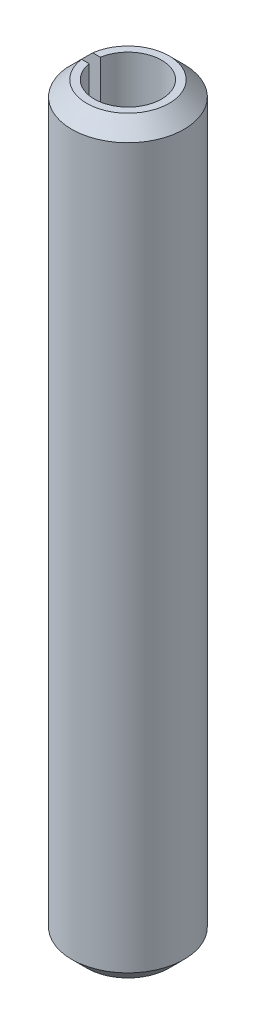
ISO-10303-21;
HEADER;
FILE_DESCRIPTION(('STEP AP214'),'2;1');
FILE_NAME('part.step','',(''),(''),'','','');
FILE_SCHEMA(('AUTOMOTIVE_DESIGN { 1 0 10303 214 1 1 1 1 }'));
ENDSEC;
DATA;
#1=APPLICATION_CONTEXT('core data for automotive mechanical design processes');
#2=APPLICATION_PROTOCOL_DEFINITION('international standard','automotive_design',2000,#1);
#3=PRODUCT_CONTEXT('',#1,'mechanical');
#4=PRODUCT('Part','Part','',(#3));
#5=PRODUCT_RELATED_PRODUCT_CATEGORY('part','',(#4));
#6=PRODUCT_DEFINITION_FORMATION('','',#4);
#7=PRODUCT_DEFINITION_CONTEXT('part definition',#1,'design');
#8=PRODUCT_DEFINITION('design','',#6,#7);
#9=PRODUCT_DEFINITION_SHAPE('','',#8);
#10=(LENGTH_UNIT() NAMED_UNIT(*) SI_UNIT(.MILLI.,.METRE.));
#11=(NAMED_UNIT(*) PLANE_ANGLE_UNIT() SI_UNIT($,.RADIAN.));
#12=(NAMED_UNIT(*) SI_UNIT($,.STERADIAN.) SOLID_ANGLE_UNIT());
#13=UNCERTAINTY_MEASURE_WITH_UNIT(LENGTH_MEASURE(1.E-05),#10,'distance_accuracy_value','');
#14=(GEOMETRIC_REPRESENTATION_CONTEXT(3) GLOBAL_UNCERTAINTY_ASSIGNED_CONTEXT((#13)) GLOBAL_UNIT_ASSIGNED_CONTEXT((#10,
#11,#12)) REPRESENTATION_CONTEXT('',''));
#15=CARTESIAN_POINT('',(0.,0.,0.));
#16=DIRECTION('',(0.,0.,1.));
#17=DIRECTION('',(1.,0.,0.));
#18=AXIS2_PLACEMENT_3D('',#15,#16,#17);
#19=CARTESIAN_POINT('',(1.8,20.,0.));
#20=DIRECTION('',(0.,-1.,0.));
#21=DIRECTION('',(0.,0.,-1.));
#22=AXIS2_PLACEMENT_3D('',#19,#20,#21);
#23=PLANE('',#22);
#24=CARTESIAN_POINT('',(0.,20.,0.));
#25=DIRECTION('',(0.,-1.,0.));
#26=DIRECTION('',(0.,0.,-1.));
#27=AXIS2_PLACEMENT_3D('',#24,#25,#26);
#28=CIRCLE('',#27,2.2);
#29=CARTESIAN_POINT('',(-2.17944947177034,20.,0.3));
#30=VERTEX_POINT('',#29);
#31=CARTESIAN_POINT('',(-2.17944947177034,20.,-0.3));
#32=VERTEX_POINT('',#31);
#33=EDGE_CURVE('E112',#30,#32,#28,.F.);
#34=ORIENTED_EDGE('',*,*,#33,.T.);
#35=DIRECTION('',(-1.,0.,0.));
#36=VECTOR('',#35,1.);
#37=CARTESIAN_POINT('',(0.,20.,-0.3));
#38=LINE('',#37,#36);
#39=CARTESIAN_POINT('',(-1.77482393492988,20.,-0.3));
#40=VERTEX_POINT('',#39);
#41=EDGE_CURVE('E162',#40,#32,#38,.T.);
#42=ORIENTED_EDGE('',*,*,#41,.F.);
#43=CARTESIAN_POINT('',(0.,20.,0.));
#44=DIRECTION('',(0.,1.,0.));
#45=DIRECTION('',(0.,0.,1.));
#46=AXIS2_PLACEMENT_3D('',#43,#44,#45);
#47=CIRCLE('',#46,1.8);
#48=CARTESIAN_POINT('',(-1.77482393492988,20.,0.3));
#49=VERTEX_POINT('',#48);
#50=EDGE_CURVE('E108',#49,#40,#47,.T.);
#51=ORIENTED_EDGE('',*,*,#50,.F.);
#52=DIRECTION('',(1.,0.,0.));
#53=VECTOR('',#52,1.);
#54=CARTESIAN_POINT('',(0.,20.,0.3));
#55=LINE('',#54,#53);
#56=EDGE_CURVE('E99',#30,#49,#55,.T.);
#57=ORIENTED_EDGE('',*,*,#56,.F.);
#58=EDGE_LOOP('',(#34,#42,#51,#57));
#59=FACE_BOUND('',#58,.T.);
#60=ADVANCED_FACE('F35',(#59),#23,.F.);
#61=CARTESIAN_POINT('',(0.,20.,0.));
#62=DIRECTION('',(0.,1.,0.));
#63=DIRECTION('',(0.,0.,1.));
#64=AXIS2_PLACEMENT_3D('',#61,#62,#63);
#65=CYLINDRICAL_SURFACE('',#64,3.);
#66=CARTESIAN_POINT('',(0.,-19.2,0.));
#67=DIRECTION('',(0.,1.,0.));
#68=DIRECTION('',(0.,0.,1.));
#69=AXIS2_PLACEMENT_3D('',#66,#67,#68);
#70=CIRCLE('',#69,3.);
#71=CARTESIAN_POINT('',(-2.98496231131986,-19.2,0.3));
#72=VERTEX_POINT('',#71);
#73=CARTESIAN_POINT('',(-2.98496231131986,-19.2,-0.3));
#74=VERTEX_POINT('',#73);
#75=EDGE_CURVE('E115',#72,#74,#70,.T.);
#76=ORIENTED_EDGE('',*,*,#75,.T.);
#77=DIRECTION('',(0.,1.,0.));
#78=VECTOR('',#77,1.);
#79=CARTESIAN_POINT('',(-2.98496231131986,20.,-0.3));
#80=LINE('',#79,#78);
#81=CARTESIAN_POINT('',(-2.98496231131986,19.2,-0.3));
#82=VERTEX_POINT('',#81);
#83=EDGE_CURVE('E54',#74,#82,#80,.T.);
#84=ORIENTED_EDGE('',*,*,#83,.T.);
#85=CARTESIAN_POINT('',(0.,19.2,0.));
#86=DIRECTION('',(0.,-1.,0.));
#87=DIRECTION('',(0.,0.,-1.));
#88=AXIS2_PLACEMENT_3D('',#85,#86,#87);
#89=CIRCLE('',#88,3.);
#90=CARTESIAN_POINT('',(-2.98496231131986,19.2,0.3));
#91=VERTEX_POINT('',#90);
#92=EDGE_CURVE('E121',#82,#91,#89,.T.);
#93=ORIENTED_EDGE('',*,*,#92,.T.);
#94=DIRECTION('',(0.,1.,0.));
#95=VECTOR('',#94,1.);
#96=CARTESIAN_POINT('',(-2.98496231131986,20.,0.3));
#97=LINE('',#96,#95);
#98=EDGE_CURVE('E143',#91,#72,#97,.F.);
#99=ORIENTED_EDGE('',*,*,#98,.T.);
#100=EDGE_LOOP('',(#76,#84,#93,#99));
#101=FACE_BOUND('',#100,.T.);
#102=ADVANCED_FACE('F168',(#101),#65,.T.);
#103=CARTESIAN_POINT('',(3.,-20.,0.));
#104=DIRECTION('',(0.,1.,0.));
#105=DIRECTION('',(0.,0.,1.));
#106=AXIS2_PLACEMENT_3D('',#103,#104,#105);
#107=PLANE('',#106);
#108=CARTESIAN_POINT('',(0.,-20.,0.));
#109=DIRECTION('',(0.,1.,0.));
#110=DIRECTION('',(0.,0.,1.));
#111=AXIS2_PLACEMENT_3D('',#108,#109,#110);
#112=CIRCLE('',#111,1.8);
#113=CARTESIAN_POINT('',(-1.77482393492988,-20.,0.3));
#114=VERTEX_POINT('',#113);
#115=CARTESIAN_POINT('',(-1.77482393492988,-20.,-0.3));
#116=VERTEX_POINT('',#115);
#117=EDGE_CURVE('E106',#114,#116,#112,.T.);
#118=ORIENTED_EDGE('',*,*,#117,.T.);
#119=DIRECTION('',(-1.,0.,0.));
#120=VECTOR('',#119,1.);
#121=CARTESIAN_POINT('',(0.,-20.,-0.3));
#122=LINE('',#121,#120);
#123=CARTESIAN_POINT('',(-2.17944947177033,-20.,-0.3));
#124=VERTEX_POINT('',#123);
#125=EDGE_CURVE('E90',#116,#124,#122,.T.);
#126=ORIENTED_EDGE('',*,*,#125,.T.);
#127=CARTESIAN_POINT('',(0.,-20.,0.));
#128=DIRECTION('',(0.,1.,0.));
#129=DIRECTION('',(0.,0.,1.));
#130=AXIS2_PLACEMENT_3D('',#127,#128,#129);
#131=CIRCLE('',#130,2.2);
#132=CARTESIAN_POINT('',(-2.17944947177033,-20.,0.3));
#133=VERTEX_POINT('',#132);
#134=EDGE_CURVE('E124',#124,#133,#131,.F.);
#135=ORIENTED_EDGE('',*,*,#134,.T.);
#136=DIRECTION('',(1.,0.,0.));
#137=VECTOR('',#136,1.);
#138=CARTESIAN_POINT('',(0.,-20.,0.3));
#139=LINE('',#138,#137);
#140=EDGE_CURVE('E62',#133,#114,#139,.T.);
#141=ORIENTED_EDGE('',*,*,#140,.T.);
#142=EDGE_LOOP('',(#118,#126,#135,#141));
#143=FACE_BOUND('',#142,.T.);
#144=ADVANCED_FACE('F111',(#143),#107,.F.);
#145=CARTESIAN_POINT('',(0.,20.,0.));
#146=DIRECTION('',(0.,1.,0.));
#147=DIRECTION('',(0.,0.,1.));
#148=AXIS2_PLACEMENT_3D('',#145,#146,#147);
#149=CYLINDRICAL_SURFACE('',#148,1.8);
#150=ORIENTED_EDGE('',*,*,#50,.T.);
#151=DIRECTION('',(0.,1.,0.));
#152=VECTOR('',#151,1.);
#153=CARTESIAN_POINT('',(-1.77482393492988,20.,-0.3));
#154=LINE('',#153,#152);
#155=EDGE_CURVE('E93',#40,#116,#154,.F.);
#156=ORIENTED_EDGE('',*,*,#155,.T.);
#157=ORIENTED_EDGE('',*,*,#117,.F.);
#158=DIRECTION('',(0.,1.,0.));
#159=VECTOR('',#158,1.);
#160=CARTESIAN_POINT('',(-1.77482393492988,20.,0.3));
#161=LINE('',#160,#159);
#162=EDGE_CURVE('E142',#114,#49,#161,.T.);
#163=ORIENTED_EDGE('',*,*,#162,.T.);
#164=EDGE_LOOP('',(#150,#156,#157,#163));
#165=FACE_BOUND('',#164,.T.);
#166=ADVANCED_FACE('F104',(#165),#149,.F.);
#167=CARTESIAN_POINT('',(0.,20.,0.));
#168=DIRECTION('',(0.,-1.,0.));
#169=DIRECTION('',(0.,0.,-1.));
#170=AXIS2_PLACEMENT_3D('',#167,#168,#169);
#171=CONICAL_SURFACE('',#170,2.2,0.785398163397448);
#172=CARTESIAN_POINT('',(-0.390246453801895,21.7077680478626,-0.3));
#173=CARTESIAN_POINT('',(-0.409115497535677,21.6927967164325,-0.3));
#174=CARTESIAN_POINT('',(-0.427797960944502,21.6775950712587,-0.3));
#175=CARTESIAN_POINT('',(-0.464864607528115,21.64683695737,-0.3));
#176=CARTESIAN_POINT('',(-0.483248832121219,21.6312805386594,-0.3));
#177=CARTESIAN_POINT('',(-0.53806098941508,21.5842427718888,-0.3));
#178=CARTESIAN_POINT('',(-0.574162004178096,21.552381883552,-0.3));
#179=CARTESIAN_POINT('',(-0.645813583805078,21.4880812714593,-0.3));
#180=CARTESIAN_POINT('',(-0.681364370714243,21.455641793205,-0.3));
#181=CARTESIAN_POINT('',(-0.752115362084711,21.3903748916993,-0.3));
#182=CARTESIAN_POINT('',(-0.787315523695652,21.3575474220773,-0.3));
#183=CARTESIAN_POINT('',(-0.898120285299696,21.2534620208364,-0.3));
#184=CARTESIAN_POINT('',(-0.973289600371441,21.181741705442,-0.3));
#185=CARTESIAN_POINT('',(-1.1230727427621,21.0377227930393,-0.3));
#186=CARTESIAN_POINT('',(-1.1976865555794,20.9654241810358,-0.3));
#187=CARTESIAN_POINT('',(-1.42105235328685,20.7480416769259,-0.3));
#188=CARTESIAN_POINT('',(-1.56932956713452,20.6024702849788,-0.3));
#189=CARTESIAN_POINT('',(-1.86548490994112,20.3107044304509,-0.3));
#190=CARTESIAN_POINT('',(-2.01336265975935,20.1645095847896,-0.3));
#191=CARTESIAN_POINT('',(-2.30883849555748,19.8718425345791,-0.3));
#192=CARTESIAN_POINT('',(-2.45643658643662,19.7253703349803,-0.3));
#193=CARTESIAN_POINT('',(-2.78560194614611,19.3983663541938,-0.3));
#194=CARTESIAN_POINT('',(-2.96712874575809,19.2177938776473,-0.3));
#195=CARTESIAN_POINT('',(-3.33004708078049,18.8565106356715,-0.3));
#196=CARTESIAN_POINT('',(-3.51143861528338,18.6757998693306,-0.3));
#197=CARTESIAN_POINT('',(-3.87394471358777,18.3144844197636,-0.3));
#198=CARTESIAN_POINT('',(-4.05505936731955,18.1338798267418,-0.3));
#199=CARTESIAN_POINT('',(-4.41722861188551,17.7726130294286,-0.3));
#200=CARTESIAN_POINT('',(-4.59828320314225,17.5919508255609,-0.3));
#201=CARTESIAN_POINT('',(-4.77932144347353,17.4112722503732,-0.3));
#202=B_SPLINE_CURVE_WITH_KNOTS('',3,(#172,#173,#174,#175,#176,#177,#178,#179,#180,#181,#182,
#183,#184,#185,#186,#187,#188,#189,#190,#191,#192,#193,#194,#195,#196,#197,#198,#199,#200,#201),
.UNSPECIFIED.,.F.,.F.,(4,2,2,2,2,2,2,2,2,2,2,2,2,2,4),(0.,0.0722546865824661,0.144499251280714,
0.288935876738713,0.433312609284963,0.577706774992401,0.889384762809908,1.20107085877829,
1.82443944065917,2.44827195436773,3.07209343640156,3.84022460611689,4.60836088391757,
5.37568403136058,6.14300166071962),.UNSPECIFIED.);
#203=EDGE_CURVE('E109',#32,#82,#202,.T.);
#204=ORIENTED_EDGE('',*,*,#203,.F.);
#205=ORIENTED_EDGE('',*,*,#33,.F.);
#206=CARTESIAN_POINT('',(-4.77932144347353,17.4112722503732,0.3));
#207=CARTESIAN_POINT('',(-4.59817671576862,17.5920569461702,0.3));
#208=CARTESIAN_POINT('',(-4.41701572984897,17.7728253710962,0.3));
#209=CARTESIAN_POINT('',(-4.05464012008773,18.134298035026,0.3));
#210=CARTESIAN_POINT('',(-3.87342549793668,18.3150022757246,0.3));
#211=CARTESIAN_POINT('',(-3.51092544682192,18.6763110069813,0.3));
#212=CARTESIAN_POINT('',(-3.32964002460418,18.8569155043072,0.3));
#213=CARTESIAN_POINT('',(-2.96692860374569,19.2179934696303,0.3));
#214=CARTESIAN_POINT('',(-2.78550260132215,19.3984669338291,0.3));
#215=CARTESIAN_POINT('',(-2.5131682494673,19.6690102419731,0.3));
#216=CARTESIAN_POINT('',(-2.42235013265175,19.7591709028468,0.3));
#217=CARTESIAN_POINT('',(-2.24062993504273,19.9394055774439,0.3));
#218=CARTESIAN_POINT('',(-2.14972785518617,20.0294795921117,0.3));
#219=CARTESIAN_POINT('',(-1.96780974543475,20.209496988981,0.3));
#220=CARTESIAN_POINT('',(-1.87679372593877,20.2994403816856,0.3));
#221=CARTESIAN_POINT('',(-1.69457283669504,20.4791428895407,0.3));
#222=CARTESIAN_POINT('',(-1.60336795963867,20.5689019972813,0.3));
#223=CARTESIAN_POINT('',(-1.42063543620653,20.7481454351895,0.3));
#224=CARTESIAN_POINT('',(-1.32910770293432,20.8376296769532,0.3));
#225=CARTESIAN_POINT('',(-1.19142022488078,20.9714365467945,0.3));
#226=CARTESIAN_POINT('',(-1.14546152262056,21.015965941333,0.3));
#227=CARTESIAN_POINT('',(-1.0533510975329,21.1048287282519,0.3));
#228=CARTESIAN_POINT('',(-1.00719936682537,21.1491621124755,0.3));
#229=CARTESIAN_POINT('',(-0.914595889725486,21.2375577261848,0.3));
#230=CARTESIAN_POINT('',(-0.868144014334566,21.2816198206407,0.3));
#231=CARTESIAN_POINT('',(-0.774818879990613,21.3692869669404,0.3));
#232=CARTESIAN_POINT('',(-0.727945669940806,21.4128920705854,0.3));
#233=CARTESIAN_POINT('',(-0.657088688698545,21.4777284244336,0.3));
#234=CARTESIAN_POINT('',(-0.633372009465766,21.4992510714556,0.3));
#235=CARTESIAN_POINT('',(-0.585697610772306,21.5420249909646,0.3));
#236=CARTESIAN_POINT('',(-0.561739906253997,21.5632762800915,0.3));
#237=CARTESIAN_POINT('',(-0.513488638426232,21.6054169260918,0.3));
#238=CARTESIAN_POINT('',(-0.489194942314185,21.6263061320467,0.3));
#239=CARTESIAN_POINT('',(-0.440122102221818,21.6675156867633,0.3));
#240=CARTESIAN_POINT('',(-0.415342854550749,21.6878359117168,0.3));
#241=CARTESIAN_POINT('',(-0.390246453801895,21.7077680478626,0.3));
#242=B_SPLINE_CURVE_WITH_KNOTS('',3,(#206,#207,#208,#209,#210,#211,#212,#213,#214,#215,#216,
#217,#218,#219,#220,#221,#222,#223,#224,#225,#226,#227,#228,#229,#230,#231,#232,#233,#234,#235,
#236,#237,#238,#239,#240,#241),.UNSPECIFIED.,.F.,.F.,(4,2,2,2,2,2,2,2,2,2,2,2,2,2,2,2,2,4),(0.,
0.767768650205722,1.53551524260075,2.30320101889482,3.07090822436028,3.45482467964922,
3.83873690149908,4.22261632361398,4.60651089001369,4.99051815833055,5.18249597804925,
5.37448171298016,5.56655632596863,5.7586089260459,5.8546872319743,5.95075961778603,
6.04687112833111,6.1430033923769),.UNSPECIFIED.);
#243=EDGE_CURVE('E136',#91,#30,#242,.T.);
#244=ORIENTED_EDGE('',*,*,#243,.F.);
#245=ORIENTED_EDGE('',*,*,#92,.F.);
#246=EDGE_LOOP('',(#204,#205,#244,#245));
#247=FACE_BOUND('',#246,.T.);
#248=ADVANCED_FACE('F146',(#247),#171,.T.);
#249=CARTESIAN_POINT('',(0.,-19.2,0.));
#250=DIRECTION('',(0.,1.,0.));
#251=DIRECTION('',(0.,0.,1.));
#252=AXIS2_PLACEMENT_3D('',#249,#250,#251);
#253=CONICAL_SURFACE('',#252,3.,0.785398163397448);
#254=CARTESIAN_POINT('',(-4.77932144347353,-17.4112722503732,-0.3));
#255=CARTESIAN_POINT('',(-4.59817671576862,-17.5920569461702,-0.3));
#256=CARTESIAN_POINT('',(-4.41701572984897,-17.7728253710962,-0.3));
#257=CARTESIAN_POINT('',(-4.05464012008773,-18.134298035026,-0.3));
#258=CARTESIAN_POINT('',(-3.87342549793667,-18.3150022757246,-0.3));
#259=CARTESIAN_POINT('',(-3.51092544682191,-18.6763110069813,-0.3));
#260=CARTESIAN_POINT('',(-3.32964002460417,-18.8569155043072,-0.3));
#261=CARTESIAN_POINT('',(-2.96692860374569,-19.2179934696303,-0.3));
#262=CARTESIAN_POINT('',(-2.78550260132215,-19.3984669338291,-0.3));
#263=CARTESIAN_POINT('',(-2.5131682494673,-19.6690102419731,-0.3));
#264=CARTESIAN_POINT('',(-2.42235013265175,-19.7591709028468,-0.3));
#265=CARTESIAN_POINT('',(-2.24062993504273,-19.9394055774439,-0.3));
#266=CARTESIAN_POINT('',(-2.14972785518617,-20.0294795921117,-0.3));
#267=CARTESIAN_POINT('',(-1.96780974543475,-20.209496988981,-0.3));
#268=CARTESIAN_POINT('',(-1.87679372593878,-20.2994403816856,-0.3));
#269=CARTESIAN_POINT('',(-1.69457283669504,-20.4791428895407,-0.3));
#270=CARTESIAN_POINT('',(-1.60336795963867,-20.5689019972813,-0.3));
#271=CARTESIAN_POINT('',(-1.42063543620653,-20.7481454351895,-0.3));
#272=CARTESIAN_POINT('',(-1.32910770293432,-20.8376296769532,-0.3));
#273=CARTESIAN_POINT('',(-1.19142022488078,-20.9714365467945,-0.3));
#274=CARTESIAN_POINT('',(-1.14546152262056,-21.015965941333,-0.3));
#275=CARTESIAN_POINT('',(-1.0533510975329,-21.1048287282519,-0.3));
#276=CARTESIAN_POINT('',(-1.00719936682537,-21.1491621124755,-0.3));
#277=CARTESIAN_POINT('',(-0.914595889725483,-21.2375577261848,-0.3));
#278=CARTESIAN_POINT('',(-0.868144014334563,-21.2816198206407,-0.3));
#279=CARTESIAN_POINT('',(-0.77481887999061,-21.3692869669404,-0.3));
#280=CARTESIAN_POINT('',(-0.727945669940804,-21.4128920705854,-0.3));
#281=CARTESIAN_POINT('',(-0.657088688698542,-21.4777284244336,-0.3));
#282=CARTESIAN_POINT('',(-0.633372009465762,-21.4992510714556,-0.3));
#283=CARTESIAN_POINT('',(-0.585697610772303,-21.5420249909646,-0.3));
#284=CARTESIAN_POINT('',(-0.561739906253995,-21.5632762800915,-0.3));
#285=CARTESIAN_POINT('',(-0.513488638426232,-21.6054169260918,-0.3));
#286=CARTESIAN_POINT('',(-0.489194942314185,-21.6263061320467,-0.3));
#287=CARTESIAN_POINT('',(-0.440122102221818,-21.6675156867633,-0.3));
#288=CARTESIAN_POINT('',(-0.415342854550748,-21.6878359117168,-0.3));
#289=CARTESIAN_POINT('',(-0.390246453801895,-21.7077680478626,-0.3));
#290=B_SPLINE_CURVE_WITH_KNOTS('',3,(#254,#255,#256,#257,#258,#259,#260,#261,#262,#263,#264,
#265,#266,#267,#268,#269,#270,#271,#272,#273,#274,#275,#276,#277,#278,#279,#280,#281,#282,#283,
#284,#285,#286,#287,#288,#289),.UNSPECIFIED.,.F.,.F.,(4,2,2,2,2,2,2,2,2,2,2,2,2,2,2,2,2,4),(0.,
0.767768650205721,1.53551524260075,2.30320101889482,3.07090822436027,3.45482467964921,
3.83873690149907,4.22261632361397,4.60651089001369,4.99051815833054,5.18249597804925,
5.37448171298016,5.56655632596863,5.7586089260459,5.8546872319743,5.95075961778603,
6.04687112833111,6.1430033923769),.UNSPECIFIED.);
#291=EDGE_CURVE('E11',#74,#124,#290,.T.);
#292=ORIENTED_EDGE('',*,*,#291,.F.);
#293=ORIENTED_EDGE('',*,*,#75,.F.);
#294=CARTESIAN_POINT('',(-0.390246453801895,-21.7077680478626,0.3));
#295=CARTESIAN_POINT('',(-0.409115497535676,-21.6927967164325,0.3));
#296=CARTESIAN_POINT('',(-0.4277979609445,-21.6775950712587,0.3));
#297=CARTESIAN_POINT('',(-0.464864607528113,-21.64683695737,0.3));
#298=CARTESIAN_POINT('',(-0.483248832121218,-21.6312805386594,0.3));
#299=CARTESIAN_POINT('',(-0.538060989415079,-21.5842427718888,0.3));
#300=CARTESIAN_POINT('',(-0.574162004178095,-21.552381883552,0.3));
#301=CARTESIAN_POINT('',(-0.645813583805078,-21.4880812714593,0.3));
#302=CARTESIAN_POINT('',(-0.681364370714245,-21.455641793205,0.3));
#303=CARTESIAN_POINT('',(-0.752115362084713,-21.3903748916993,0.3));
#304=CARTESIAN_POINT('',(-0.787315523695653,-21.3575474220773,0.3));
#305=CARTESIAN_POINT('',(-0.898120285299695,-21.2534620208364,0.3));
#306=CARTESIAN_POINT('',(-0.973289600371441,-21.181741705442,0.3));
#307=CARTESIAN_POINT('',(-1.1230727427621,-21.0377227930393,0.3));
#308=CARTESIAN_POINT('',(-1.1976865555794,-20.9654241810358,0.3));
#309=CARTESIAN_POINT('',(-1.42105235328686,-20.7480416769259,0.3));
#310=CARTESIAN_POINT('',(-1.56932956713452,-20.6024702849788,0.3));
#311=CARTESIAN_POINT('',(-1.86548490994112,-20.3107044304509,0.3));
#312=CARTESIAN_POINT('',(-2.01336265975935,-20.1645095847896,0.3));
#313=CARTESIAN_POINT('',(-2.30883849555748,-19.8718425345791,0.3));
#314=CARTESIAN_POINT('',(-2.45643658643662,-19.7253703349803,0.3));
#315=CARTESIAN_POINT('',(-2.78560194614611,-19.3983663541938,0.3));
#316=CARTESIAN_POINT('',(-2.96712874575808,-19.2177938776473,0.3));
#317=CARTESIAN_POINT('',(-3.33004708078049,-18.8565106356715,0.3));
#318=CARTESIAN_POINT('',(-3.51143861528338,-18.6757998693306,0.3));
#319=CARTESIAN_POINT('',(-3.87394471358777,-18.3144844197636,0.3));
#320=CARTESIAN_POINT('',(-4.05505936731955,-18.1338798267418,0.3));
#321=CARTESIAN_POINT('',(-4.41722861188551,-17.7726130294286,0.3));
#322=CARTESIAN_POINT('',(-4.59828320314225,-17.5919508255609,0.3));
#323=CARTESIAN_POINT('',(-4.77932144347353,-17.4112722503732,0.3));
#324=B_SPLINE_CURVE_WITH_KNOTS('',3,(#294,#295,#296,#297,#298,#299,#300,#301,#302,#303,#304,
#305,#306,#307,#308,#309,#310,#311,#312,#313,#314,#315,#316,#317,#318,#319,#320,#321,#322,#323),
.UNSPECIFIED.,.F.,.F.,(4,2,2,2,2,2,2,2,2,2,2,2,2,2,4),(0.,0.0722546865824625,0.144499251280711,
0.288935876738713,0.433312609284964,0.577706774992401,0.889384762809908,1.2010708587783,
1.82443944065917,2.44827195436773,3.07209343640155,3.84022460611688,4.60836088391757,
5.37568403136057,6.14300166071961),.UNSPECIFIED.);
#325=EDGE_CURVE('E48',#133,#72,#324,.T.);
#326=ORIENTED_EDGE('',*,*,#325,.F.);
#327=ORIENTED_EDGE('',*,*,#134,.F.);
#328=EDGE_LOOP('',(#292,#293,#326,#327));
#329=FACE_BOUND('',#328,.T.);
#330=ADVANCED_FACE('F37',(#329),#253,.T.);
#331=CARTESIAN_POINT('',(0.,-20.,0.3));
#332=DIRECTION('',(0.,0.,1.));
#333=DIRECTION('',(1.,0.,0.));
#334=AXIS2_PLACEMENT_3D('',#331,#332,#333);
#335=PLANE('',#334);
#336=ORIENTED_EDGE('',*,*,#140,.F.);
#337=ORIENTED_EDGE('',*,*,#325,.T.);
#338=ORIENTED_EDGE('',*,*,#98,.F.);
#339=ORIENTED_EDGE('',*,*,#243,.T.);
#340=ORIENTED_EDGE('',*,*,#56,.T.);
#341=ORIENTED_EDGE('',*,*,#162,.F.);
#342=EDGE_LOOP('',(#336,#337,#338,#339,#340,#341));
#343=FACE_BOUND('',#342,.T.);
#344=ADVANCED_FACE('F129',(#343),#335,.F.);
#345=CARTESIAN_POINT('',(0.,-20.,-0.3));
#346=DIRECTION('',(0.,0.,-1.));
#347=DIRECTION('',(-1.,0.,0.));
#348=AXIS2_PLACEMENT_3D('',#345,#346,#347);
#349=PLANE('',#348);
#350=ORIENTED_EDGE('',*,*,#41,.T.);
#351=ORIENTED_EDGE('',*,*,#203,.T.);
#352=ORIENTED_EDGE('',*,*,#83,.F.);
#353=ORIENTED_EDGE('',*,*,#291,.T.);
#354=ORIENTED_EDGE('',*,*,#125,.F.);
#355=ORIENTED_EDGE('',*,*,#155,.F.);
#356=EDGE_LOOP('',(#350,#351,#352,#353,#354,#355));
#357=FACE_BOUND('',#356,.T.);
#358=ADVANCED_FACE('F92',(#357),#349,.F.);
#359=CLOSED_SHELL('',(#60,#102,#144,#166,#248,#330,#344,#358));
#360=MANIFOLD_SOLID_BREP('B2',#359);
#361=ADVANCED_BREP_SHAPE_REPRESENTATION('',(#18,#360),#14);
#362=SHAPE_DEFINITION_REPRESENTATION(#9,#361);
ENDSEC;
END-ISO-10303-21;
